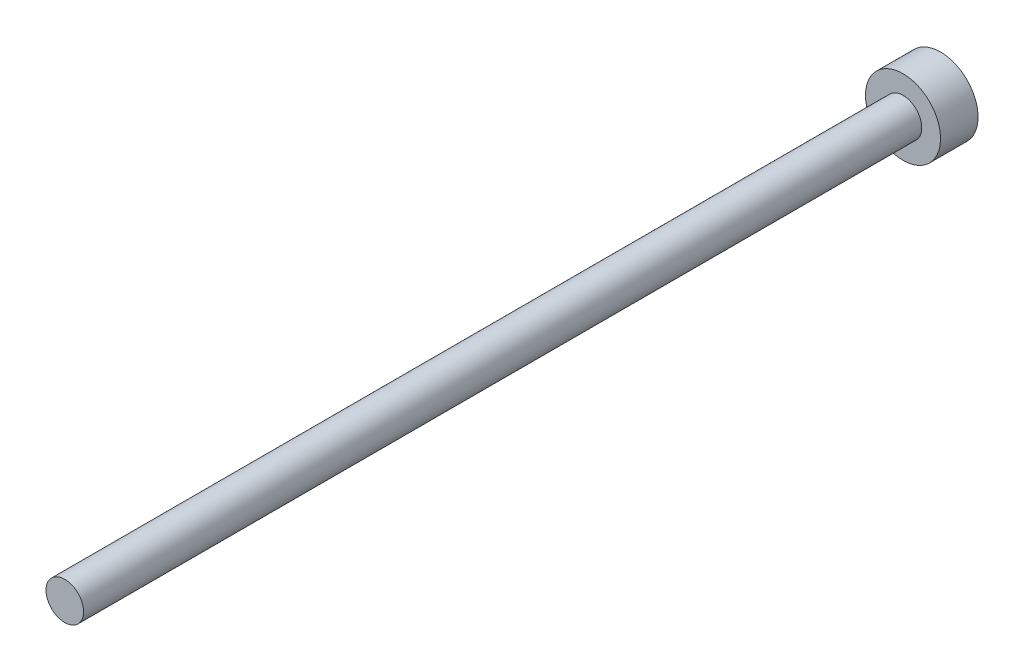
from build123d import *

# Parameters (mm, degrees)
ESQUISSE1_R      = 3
EXTRUSION1_DEPTH = 3
ESQUISSE2_R      = 1.5
EXTRUSION2_DEPTH = 67


with BuildPart() as part:
    # Esquisse1 → Extrusion1 (new body)
    with BuildSketch(Plane.XY):
        Circle(ESQUISSE1_R)
    extrude(amount=EXTRUSION1_DEPTH)

    # Esquisse2 → Extrusion2 (add)
    with BuildSketch(Plane.XY.offset(3)):
        with Locations(Location((0, 0, 0), (0, 0, 180))):
            Circle(ESQUISSE2_R)
    extrude(amount=EXTRUSION2_DEPTH)


solid = part.part
